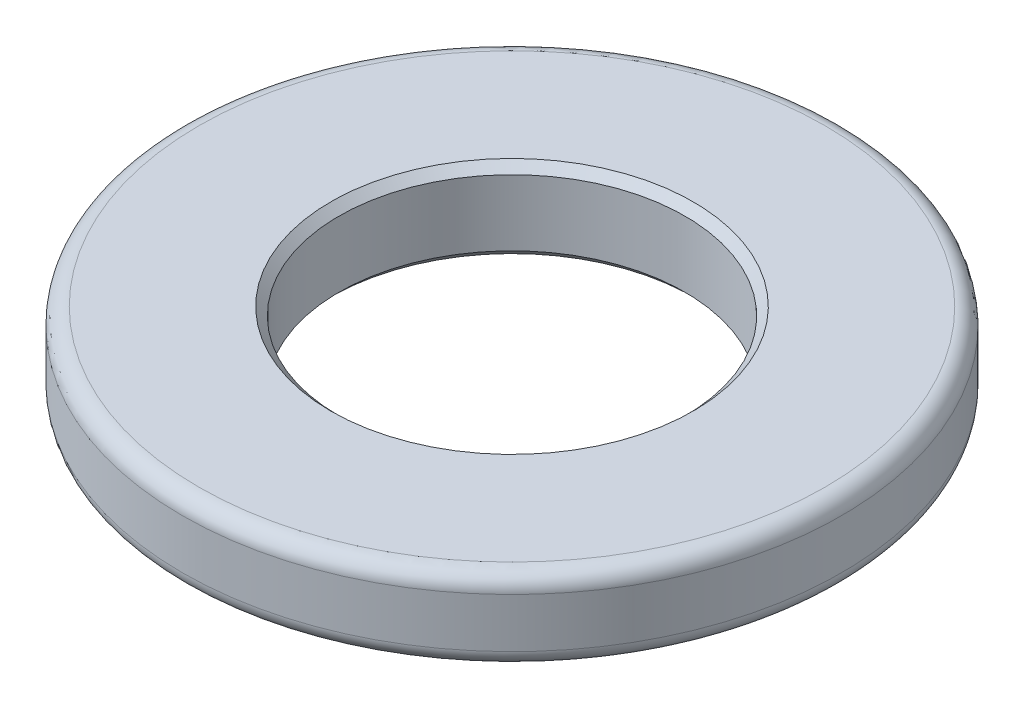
from build123d import *

# Parameters (mm, degrees)
SKETCH1_R           = 4
SKETCH1_R_2         = 2.1
BOSS_EXTRUDE1_DEPTH = 1
FILLET1_R           = 0.2
CHAMFER1_SIZE       = 0.1


with BuildPart() as part:
    # Sketch1 → Boss-Extrude1 (new body)
    with BuildSketch(Plane(origin=(0, 0, 0), x_dir=(1, 0, 0), z_dir=(0, 1, 0))):
        with Locations(Location((0, 0, 0), (0, 0, 270))):
            Circle(SKETCH1_R)
        with Locations(Location((0, 0, 0), (0, 0, 270))):
            Circle(SKETCH1_R_2, mode=Mode.SUBTRACT)
    extrude(amount=BOSS_EXTRUDE1_DEPTH)

    # Fillet1
    fillet1_edges = [part.edges().sort_by_distance(p)[0] for p in [
        (0, 0, -4),
        (0, 1, -4),
    ]]
    fillet(fillet1_edges, radius=FILLET1_R)

    # Chamfer1
    chamfer1_edges = [part.edges().sort_by_distance(p)[0] for p in [
        (0, 0, -2.1),
        (0, 1, -2.1),
    ]]
    chamfer(chamfer1_edges, length=CHAMFER1_SIZE)


solid = part.part
